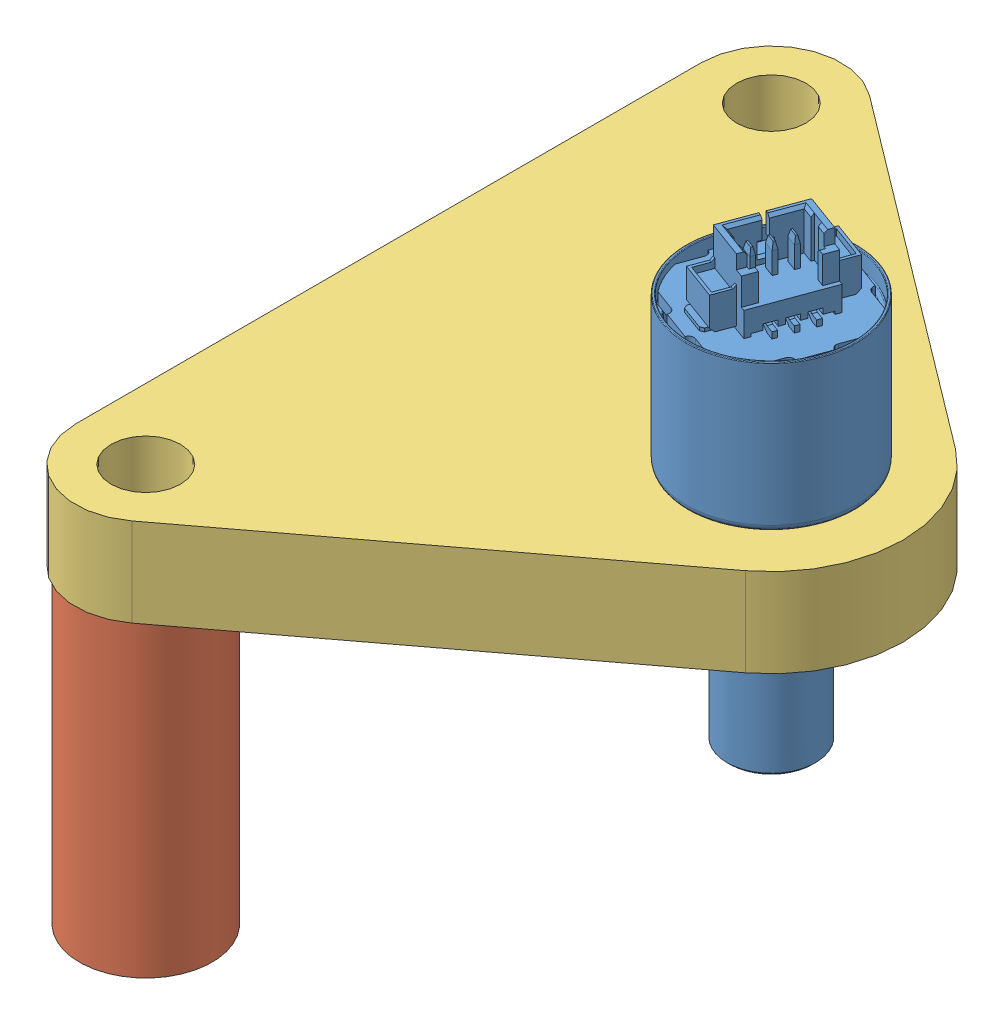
SolidWorks assembly Potentiometer Mount Assem for intake.SLDASM, configuration Default (file format 8000). Lengths in mm.
Overall size (65.37 43.59 65.37).
4 component instances, 3 part files, 6 mates.
Components (placement in the parent):
- MA3-P10-250-N-1: MA3-P10-250-N.SLDPRT [Default] at (34.1849 22.2424 0.6163) x (0 -1 0) z (0.345702 0 -0.938344) size (32.18 14.32 14.3)
- StandOff .825-1: StandOff .825.SLDPRT [Default] at (11.7343 0.1952 -21.8343) x (0.981151 0 0.19324) z (-0.19324 0 0.981151) size (9.53 22.23 9.53)
- Intake Potetentiometer-2: Intake Potetentiometer.SLDPRT [Default] at (34.1849 28.7702 0.6163) x (0.707107 0 -0.707107) z (0 -1 0) size (46.22 46.22 6.35)
- StandOff .825-2: StandOff .825.SLDPRT [Default] at (11.7343 0.1952 23.067) x (0.981151 0 0.19324) z (-0.19324 0 0.981151) size (9.53 22.23 9.53)
Mates (geometry in assembly coordinates):
- Concentric1: concentric anti-aligned: cylinder of StandOff .825-1 through (6.2659 22.4202 -25.3685) axis (0 -1 0) radius 2.4892; cylinder of Intake Potetentiometer-2 through (6.2659 22.4202 -25.3685) axis (0 1 0) radius 2.4892
- Concentric2: concentric anti-aligned: cylinder of MA3-P10-250-N-1 through (28.7165 22.2424 -2.9179) axis (0 -1 0) radius 6.096; cylinder of Intake Potetentiometer-2 through (28.7165 22.4202 -2.9179) axis (0 1 0) radius 4.3656
- Coincident2: coincident anti-aligned: plane of MA3-P10-250-N-1 through (24.5694 28.7702 -4.4457) normal (0 -1 0); plane of Intake Potetentiometer-2 through (6.2659 28.7702 19.5328) normal (0 1 0)
- Parallel3: parallel anti-aligned: plane of Intake Potetentiometer-2 through (1.2367 22.4202 -25.3685) normal (-1 0 0); plane of assembly through (0 0 0) normal (1 0 0)
- Coincident5: coincident: circle of Intake Potetentiometer-2; cylinder of StandOff .825-2 through (11.7343 22.4202 23.067) axis (0 -1 0) radius 2.4892
- Coincident6: coincident anti-aligned: plane of Intake Potetentiometer-2 through (11.7343 22.4202 23.067) normal (0 -1 0); plane of StandOff .825-2 through (11.7343 22.4202 23.067) normal (0 1 0)
